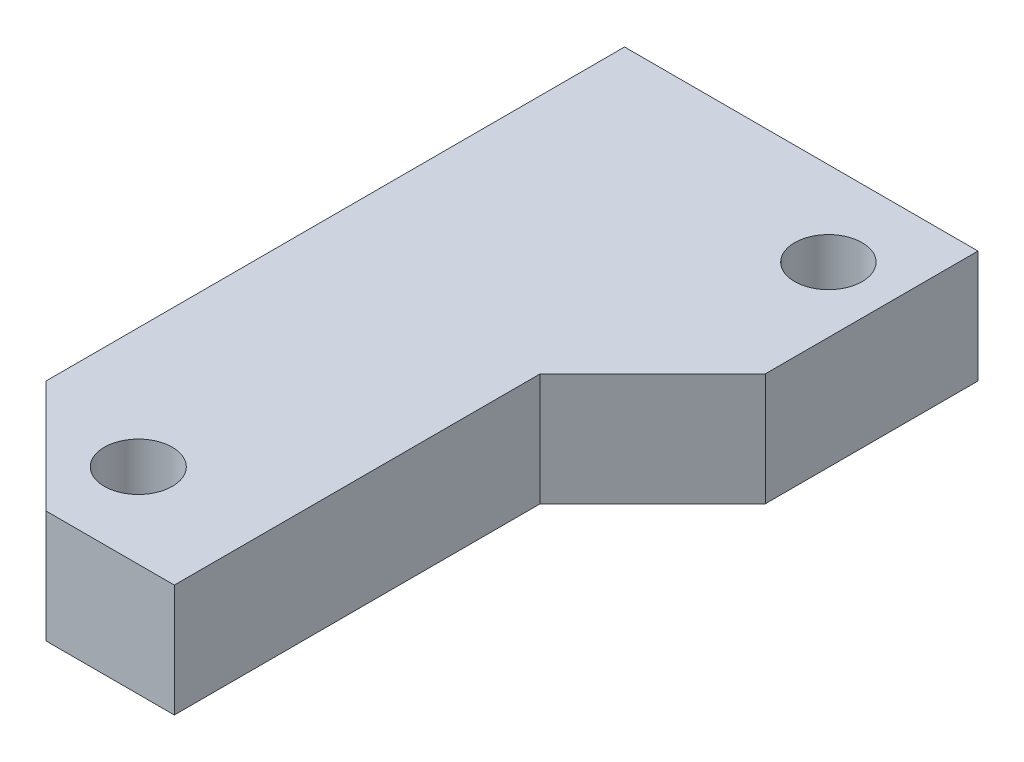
ISO-10303-21;
HEADER;
FILE_DESCRIPTION(('STEP AP214'),'2;1');
FILE_NAME('part.step','',(''),(''),'','','');
FILE_SCHEMA(('AUTOMOTIVE_DESIGN { 1 0 10303 214 1 1 1 1 }'));
ENDSEC;
DATA;
#1=APPLICATION_CONTEXT('core data for automotive mechanical design processes');
#2=APPLICATION_PROTOCOL_DEFINITION('international standard','automotive_design',2000,#1);
#3=PRODUCT_CONTEXT('',#1,'mechanical');
#4=PRODUCT('Part','Part','',(#3));
#5=PRODUCT_RELATED_PRODUCT_CATEGORY('part','',(#4));
#6=PRODUCT_DEFINITION_FORMATION('','',#4);
#7=PRODUCT_DEFINITION_CONTEXT('part definition',#1,'design');
#8=PRODUCT_DEFINITION('design','',#6,#7);
#9=PRODUCT_DEFINITION_SHAPE('','',#8);
#10=(LENGTH_UNIT() NAMED_UNIT(*) SI_UNIT(.MILLI.,.METRE.));
#11=(NAMED_UNIT(*) PLANE_ANGLE_UNIT() SI_UNIT($,.RADIAN.));
#12=(NAMED_UNIT(*) SI_UNIT($,.STERADIAN.) SOLID_ANGLE_UNIT());
#13=UNCERTAINTY_MEASURE_WITH_UNIT(LENGTH_MEASURE(1.E-05),#10,'distance_accuracy_value','');
#14=(GEOMETRIC_REPRESENTATION_CONTEXT(3) GLOBAL_UNCERTAINTY_ASSIGNED_CONTEXT((#13)) GLOBAL_UNIT_ASSIGNED_CONTEXT((#10,
#11,#12)) REPRESENTATION_CONTEXT('',''));
#15=CARTESIAN_POINT('',(0.,0.,0.));
#16=DIRECTION('',(0.,0.,1.));
#17=DIRECTION('',(1.,0.,0.));
#18=AXIS2_PLACEMENT_3D('',#15,#16,#17);
#19=CARTESIAN_POINT('',(51.78,-4.,-3.71999999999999));
#20=DIRECTION('',(1.,0.,0.));
#21=DIRECTION('',(0.,0.,-1.));
#22=AXIS2_PLACEMENT_3D('',#19,#20,#21);
#23=PLANE('',#22);
#24=DIRECTION('',(0.,0.,-1.));
#25=VECTOR('',#24,1.);
#26=CARTESIAN_POINT('',(51.78,0.,-3.71999999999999));
#27=LINE('',#26,#25);
#28=CARTESIAN_POINT('',(51.78,0.,-3.71999999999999));
#29=VERTEX_POINT('',#28);
#30=CARTESIAN_POINT('',(51.78,0.,-11.28));
#31=VERTEX_POINT('',#30);
#32=EDGE_CURVE('E124',#29,#31,#27,.T.);
#33=ORIENTED_EDGE('',*,*,#32,.F.);
#34=DIRECTION('',(0.,1.,0.));
#35=VECTOR('',#34,1.);
#36=CARTESIAN_POINT('',(51.78,-4.,-3.71999999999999));
#37=LINE('',#36,#35);
#38=CARTESIAN_POINT('',(51.78,-4.,-3.71999999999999));
#39=VERTEX_POINT('',#38);
#40=EDGE_CURVE('E11',#39,#29,#37,.T.);
#41=ORIENTED_EDGE('',*,*,#40,.F.);
#42=DIRECTION('',(0.,0.,-1.));
#43=VECTOR('',#42,1.);
#44=CARTESIAN_POINT('',(51.78,-4.,-3.71999999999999));
#45=LINE('',#44,#43);
#46=CARTESIAN_POINT('',(51.78,-4.,-11.28));
#47=VERTEX_POINT('',#46);
#48=EDGE_CURVE('E142',#39,#47,#45,.T.);
#49=ORIENTED_EDGE('',*,*,#48,.T.);
#50=DIRECTION('',(0.,1.,0.));
#51=VECTOR('',#50,1.);
#52=CARTESIAN_POINT('',(51.78,-4.,-11.28));
#53=LINE('',#52,#51);
#54=EDGE_CURVE('E36',#47,#31,#53,.T.);
#55=ORIENTED_EDGE('',*,*,#54,.T.);
#56=EDGE_LOOP('',(#33,#41,#49,#55));
#57=FACE_BOUND('',#56,.T.);
#58=ADVANCED_FACE('F33',(#57),#23,.T.);
#59=CARTESIAN_POINT('',(47.78,-4.,0.280000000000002));
#60=DIRECTION('',(0.707106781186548,0.,0.707106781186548));
#61=DIRECTION('',(0.707106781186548,0.,-0.707106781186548));
#62=AXIS2_PLACEMENT_3D('',#59,#60,#61);
#63=PLANE('',#62);
#64=DIRECTION('',(0.707106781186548,0.,-0.707106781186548));
#65=VECTOR('',#64,1.);
#66=CARTESIAN_POINT('',(47.78,0.,0.280000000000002));
#67=LINE('',#66,#65);
#68=CARTESIAN_POINT('',(47.78,0.,0.280000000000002));
#69=VERTEX_POINT('',#68);
#70=EDGE_CURVE('E140',#69,#29,#67,.T.);
#71=ORIENTED_EDGE('',*,*,#70,.F.);
#72=DIRECTION('',(0.,1.,0.));
#73=VECTOR('',#72,1.);
#74=CARTESIAN_POINT('',(47.78,-4.,0.280000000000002));
#75=LINE('',#74,#73);
#76=CARTESIAN_POINT('',(47.78,-4.,0.280000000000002));
#77=VERTEX_POINT('',#76);
#78=EDGE_CURVE('E42',#77,#69,#75,.T.);
#79=ORIENTED_EDGE('',*,*,#78,.F.);
#80=DIRECTION('',(0.707106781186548,0.,-0.707106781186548));
#81=VECTOR('',#80,1.);
#82=CARTESIAN_POINT('',(47.78,-4.,0.280000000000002));
#83=LINE('',#82,#81);
#84=EDGE_CURVE('E114',#77,#39,#83,.T.);
#85=ORIENTED_EDGE('',*,*,#84,.T.);
#86=ORIENTED_EDGE('',*,*,#40,.T.);
#87=EDGE_LOOP('',(#71,#79,#85,#86));
#88=FACE_BOUND('',#87,.T.);
#89=ADVANCED_FACE('F152',(#88),#63,.T.);
#90=CARTESIAN_POINT('',(47.78,-4.,13.28));
#91=DIRECTION('',(1.,0.,0.));
#92=DIRECTION('',(0.,0.,-1.));
#93=AXIS2_PLACEMENT_3D('',#90,#91,#92);
#94=PLANE('',#93);
#95=DIRECTION('',(0.,0.,-1.));
#96=VECTOR('',#95,1.);
#97=CARTESIAN_POINT('',(47.78,0.,13.28));
#98=LINE('',#97,#96);
#99=CARTESIAN_POINT('',(47.78,0.,13.28));
#100=VERTEX_POINT('',#99);
#101=EDGE_CURVE('E101',#100,#69,#98,.T.);
#102=ORIENTED_EDGE('',*,*,#101,.F.);
#103=DIRECTION('',(0.,1.,0.));
#104=VECTOR('',#103,1.);
#105=CARTESIAN_POINT('',(47.78,-4.,13.28));
#106=LINE('',#105,#104);
#107=CARTESIAN_POINT('',(47.78,-4.,13.28));
#108=VERTEX_POINT('',#107);
#109=EDGE_CURVE('E96',#108,#100,#106,.T.);
#110=ORIENTED_EDGE('',*,*,#109,.F.);
#111=DIRECTION('',(0.,0.,-1.));
#112=VECTOR('',#111,1.);
#113=CARTESIAN_POINT('',(47.78,-4.,13.28));
#114=LINE('',#113,#112);
#115=EDGE_CURVE('E99',#108,#77,#114,.T.);
#116=ORIENTED_EDGE('',*,*,#115,.T.);
#117=ORIENTED_EDGE('',*,*,#78,.T.);
#118=EDGE_LOOP('',(#102,#110,#116,#117));
#119=FACE_BOUND('',#118,.T.);
#120=ADVANCED_FACE('F98',(#119),#94,.T.);
#121=CARTESIAN_POINT('',(43.22,-4.,13.28));
#122=DIRECTION('',(0.,0.,1.));
#123=DIRECTION('',(1.,0.,0.));
#124=AXIS2_PLACEMENT_3D('',#121,#122,#123);
#125=PLANE('',#124);
#126=DIRECTION('',(1.,0.,0.));
#127=VECTOR('',#126,1.);
#128=CARTESIAN_POINT('',(43.22,0.,13.28));
#129=LINE('',#128,#127);
#130=CARTESIAN_POINT('',(43.22,0.,13.28));
#131=VERTEX_POINT('',#130);
#132=EDGE_CURVE('E137',#131,#100,#129,.T.);
#133=ORIENTED_EDGE('',*,*,#132,.F.);
#134=DIRECTION('',(0.,1.,0.));
#135=VECTOR('',#134,1.);
#136=CARTESIAN_POINT('',(43.22,-4.,13.28));
#137=LINE('',#136,#135);
#138=CARTESIAN_POINT('',(43.22,-4.,13.28));
#139=VERTEX_POINT('',#138);
#140=EDGE_CURVE('E106',#139,#131,#137,.T.);
#141=ORIENTED_EDGE('',*,*,#140,.F.);
#142=DIRECTION('',(1.,0.,0.));
#143=VECTOR('',#142,1.);
#144=CARTESIAN_POINT('',(43.22,-4.,13.28));
#145=LINE('',#144,#143);
#146=EDGE_CURVE('E112',#139,#108,#145,.T.);
#147=ORIENTED_EDGE('',*,*,#146,.T.);
#148=ORIENTED_EDGE('',*,*,#109,.T.);
#149=EDGE_LOOP('',(#133,#141,#147,#148));
#150=FACE_BOUND('',#149,.T.);
#151=ADVANCED_FACE('F116',(#150),#125,.T.);
#152=CARTESIAN_POINT('',(39.22,-4.,9.28000000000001));
#153=DIRECTION('',(-0.707106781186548,0.,0.707106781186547));
#154=DIRECTION('',(0.707106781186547,0.,0.707106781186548));
#155=AXIS2_PLACEMENT_3D('',#152,#153,#154);
#156=PLANE('',#155);
#157=DIRECTION('',(0.707106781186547,0.,0.707106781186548));
#158=VECTOR('',#157,1.);
#159=CARTESIAN_POINT('',(39.22,0.,9.28000000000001));
#160=LINE('',#159,#158);
#161=CARTESIAN_POINT('',(39.22,0.,9.28000000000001));
#162=VERTEX_POINT('',#161);
#163=EDGE_CURVE('E134',#162,#131,#160,.T.);
#164=ORIENTED_EDGE('',*,*,#163,.F.);
#165=DIRECTION('',(0.,1.,0.));
#166=VECTOR('',#165,1.);
#167=CARTESIAN_POINT('',(39.22,-4.,9.28000000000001));
#168=LINE('',#167,#166);
#169=CARTESIAN_POINT('',(39.22,-4.,9.28000000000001));
#170=VERTEX_POINT('',#169);
#171=EDGE_CURVE('E146',#170,#162,#168,.T.);
#172=ORIENTED_EDGE('',*,*,#171,.F.);
#173=DIRECTION('',(0.707106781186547,0.,0.707106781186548));
#174=VECTOR('',#173,1.);
#175=CARTESIAN_POINT('',(39.22,-4.,9.28000000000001));
#176=LINE('',#175,#174);
#177=EDGE_CURVE('E117',#170,#139,#176,.T.);
#178=ORIENTED_EDGE('',*,*,#177,.T.);
#179=ORIENTED_EDGE('',*,*,#140,.T.);
#180=EDGE_LOOP('',(#164,#172,#178,#179));
#181=FACE_BOUND('',#180,.T.);
#182=ADVANCED_FACE('F165',(#181),#156,.T.);
#183=CARTESIAN_POINT('',(39.22,-4.,-11.28));
#184=DIRECTION('',(-1.,0.,0.));
#185=DIRECTION('',(0.,0.,1.));
#186=AXIS2_PLACEMENT_3D('',#183,#184,#185);
#187=PLANE('',#186);
#188=DIRECTION('',(0.,0.,1.));
#189=VECTOR('',#188,1.);
#190=CARTESIAN_POINT('',(39.22,0.,-11.28));
#191=LINE('',#190,#189);
#192=CARTESIAN_POINT('',(39.22,0.,-11.28));
#193=VERTEX_POINT('',#192);
#194=EDGE_CURVE('E131',#193,#162,#191,.T.);
#195=ORIENTED_EDGE('',*,*,#194,.F.);
#196=DIRECTION('',(0.,1.,0.));
#197=VECTOR('',#196,1.);
#198=CARTESIAN_POINT('',(39.22,-4.,-11.28));
#199=LINE('',#198,#197);
#200=CARTESIAN_POINT('',(39.22,-4.,-11.28));
#201=VERTEX_POINT('',#200);
#202=EDGE_CURVE('E147',#201,#193,#199,.T.);
#203=ORIENTED_EDGE('',*,*,#202,.F.);
#204=DIRECTION('',(0.,0.,1.));
#205=VECTOR('',#204,1.);
#206=CARTESIAN_POINT('',(39.22,-4.,-11.28));
#207=LINE('',#206,#205);
#208=EDGE_CURVE('E119',#201,#170,#207,.T.);
#209=ORIENTED_EDGE('',*,*,#208,.T.);
#210=ORIENTED_EDGE('',*,*,#171,.T.);
#211=EDGE_LOOP('',(#195,#203,#209,#210));
#212=FACE_BOUND('',#211,.T.);
#213=ADVANCED_FACE('F168',(#212),#187,.T.);
#214=CARTESIAN_POINT('',(51.78,-4.,-11.28));
#215=DIRECTION('',(0.,0.,-1.));
#216=DIRECTION('',(-1.,0.,0.));
#217=AXIS2_PLACEMENT_3D('',#214,#215,#216);
#218=PLANE('',#217);
#219=DIRECTION('',(-1.,0.,0.));
#220=VECTOR('',#219,1.);
#221=CARTESIAN_POINT('',(51.78,0.,-11.28));
#222=LINE('',#221,#220);
#223=EDGE_CURVE('E127',#31,#193,#222,.T.);
#224=ORIENTED_EDGE('',*,*,#223,.F.);
#225=ORIENTED_EDGE('',*,*,#54,.F.);
#226=DIRECTION('',(-1.,0.,0.));
#227=VECTOR('',#226,1.);
#228=CARTESIAN_POINT('',(51.78,-4.,-11.28));
#229=LINE('',#228,#227);
#230=EDGE_CURVE('E208',#47,#201,#229,.T.);
#231=ORIENTED_EDGE('',*,*,#230,.T.);
#232=ORIENTED_EDGE('',*,*,#202,.T.);
#233=EDGE_LOOP('',(#224,#225,#231,#232));
#234=FACE_BOUND('',#233,.T.);
#235=ADVANCED_FACE('F149',(#234),#218,.T.);
#236=CARTESIAN_POINT('',(0.,-4.,0.));
#237=DIRECTION('',(0.,1.,0.));
#238=DIRECTION('',(0.,0.,1.));
#239=AXIS2_PLACEMENT_3D('',#236,#237,#238);
#240=PLANE('',#239);
#241=CARTESIAN_POINT('',(43.5,-4.,10.28));
#242=DIRECTION('',(0.,1.,0.));
#243=DIRECTION('',(0.,0.,1.));
#244=AXIS2_PLACEMENT_3D('',#241,#242,#243);
#245=CIRCLE('',#244,1.20768339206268);
#246=CARTESIAN_POINT('',(43.5,-4.,11.4876833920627));
#247=VERTEX_POINT('',#246);
#248=EDGE_CURVE('E195',#247,#247,#245,.T.);
#249=ORIENTED_EDGE('',*,*,#248,.T.);
#250=EDGE_LOOP('',(#249));
#251=FACE_BOUND('',#250,.T.);
#252=CARTESIAN_POINT('',(49.4633855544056,-4.,-8.28000000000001));
#253=DIRECTION('',(0.,1.,0.));
#254=DIRECTION('',(0.,0.,1.));
#255=AXIS2_PLACEMENT_3D('',#252,#253,#254);
#256=CIRCLE('',#255,1.2);
#257=CARTESIAN_POINT('',(49.4633855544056,-4.,-7.08000000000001));
#258=VERTEX_POINT('',#257);
#259=EDGE_CURVE('E128',#258,#258,#256,.T.);
#260=ORIENTED_EDGE('',*,*,#259,.T.);
#261=EDGE_LOOP('',(#260));
#262=FACE_BOUND('',#261,.T.);
#263=ORIENTED_EDGE('',*,*,#48,.F.);
#264=ORIENTED_EDGE('',*,*,#84,.F.);
#265=ORIENTED_EDGE('',*,*,#115,.F.);
#266=ORIENTED_EDGE('',*,*,#146,.F.);
#267=ORIENTED_EDGE('',*,*,#177,.F.);
#268=ORIENTED_EDGE('',*,*,#208,.F.);
#269=ORIENTED_EDGE('',*,*,#230,.F.);
#270=EDGE_LOOP('',(#263,#264,#265,#266,#267,#268,#269));
#271=FACE_BOUND('',#270,.T.);
#272=ADVANCED_FACE('F110',(#251,#262,#271),#240,.F.);
#273=CARTESIAN_POINT('',(0.,0.,0.));
#274=DIRECTION('',(0.,1.,0.));
#275=DIRECTION('',(0.,0.,1.));
#276=AXIS2_PLACEMENT_3D('',#273,#274,#275);
#277=PLANE('',#276);
#278=CARTESIAN_POINT('',(43.5,0.,10.28));
#279=DIRECTION('',(0.,1.,0.));
#280=DIRECTION('',(0.,0.,1.));
#281=AXIS2_PLACEMENT_3D('',#278,#279,#280);
#282=CIRCLE('',#281,1.20768339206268);
#283=CARTESIAN_POINT('',(43.5,0.,11.4876833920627));
#284=VERTEX_POINT('',#283);
#285=EDGE_CURVE('E198',#284,#284,#282,.T.);
#286=ORIENTED_EDGE('',*,*,#285,.F.);
#287=EDGE_LOOP('',(#286));
#288=FACE_BOUND('',#287,.T.);
#289=CARTESIAN_POINT('',(49.4633855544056,0.,-8.28000000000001));
#290=DIRECTION('',(0.,1.,0.));
#291=DIRECTION('',(0.,0.,1.));
#292=AXIS2_PLACEMENT_3D('',#289,#290,#291);
#293=CIRCLE('',#292,1.2);
#294=CARTESIAN_POINT('',(49.4633855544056,0.,-7.08000000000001));
#295=VERTEX_POINT('',#294);
#296=EDGE_CURVE('E200',#295,#295,#293,.T.);
#297=ORIENTED_EDGE('',*,*,#296,.F.);
#298=EDGE_LOOP('',(#297));
#299=FACE_BOUND('',#298,.T.);
#300=ORIENTED_EDGE('',*,*,#32,.T.);
#301=ORIENTED_EDGE('',*,*,#223,.T.);
#302=ORIENTED_EDGE('',*,*,#194,.T.);
#303=ORIENTED_EDGE('',*,*,#163,.T.);
#304=ORIENTED_EDGE('',*,*,#132,.T.);
#305=ORIENTED_EDGE('',*,*,#101,.T.);
#306=ORIENTED_EDGE('',*,*,#70,.T.);
#307=EDGE_LOOP('',(#300,#301,#302,#303,#304,#305,#306));
#308=FACE_BOUND('',#307,.T.);
#309=ADVANCED_FACE('F151',(#288,#299,#308),#277,.T.);
#310=CARTESIAN_POINT('',(49.4633855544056,-4.,-8.28000000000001));
#311=DIRECTION('',(0.,1.,0.));
#312=DIRECTION('',(0.,0.,1.));
#313=AXIS2_PLACEMENT_3D('',#310,#311,#312);
#314=CYLINDRICAL_SURFACE('',#313,1.2);
#315=ORIENTED_EDGE('',*,*,#259,.F.);
#316=EDGE_LOOP('',(#315));
#317=FACE_BOUND('',#316,.T.);
#318=ORIENTED_EDGE('',*,*,#296,.T.);
#319=EDGE_LOOP('',(#318));
#320=FACE_BOUND('',#319,.T.);
#321=ADVANCED_FACE('F180',(#317,#320),#314,.F.);
#322=CARTESIAN_POINT('',(43.5,-4.,10.28));
#323=DIRECTION('',(0.,1.,0.));
#324=DIRECTION('',(0.,0.,1.));
#325=AXIS2_PLACEMENT_3D('',#322,#323,#324);
#326=CYLINDRICAL_SURFACE('',#325,1.20768339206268);
#327=ORIENTED_EDGE('',*,*,#248,.F.);
#328=EDGE_LOOP('',(#327));
#329=FACE_BOUND('',#328,.T.);
#330=ORIENTED_EDGE('',*,*,#285,.T.);
#331=EDGE_LOOP('',(#330));
#332=FACE_BOUND('',#331,.T.);
#333=ADVANCED_FACE('F187',(#329,#332),#326,.F.);
#334=CLOSED_SHELL('',(#58,#89,#120,#151,#182,#213,#235,#272,#309,#321,#333));
#335=MANIFOLD_SOLID_BREP('B2',#334);
#336=ADVANCED_BREP_SHAPE_REPRESENTATION('',(#18,#335),#14);
#337=SHAPE_DEFINITION_REPRESENTATION(#9,#336);
ENDSEC;
END-ISO-10303-21;
